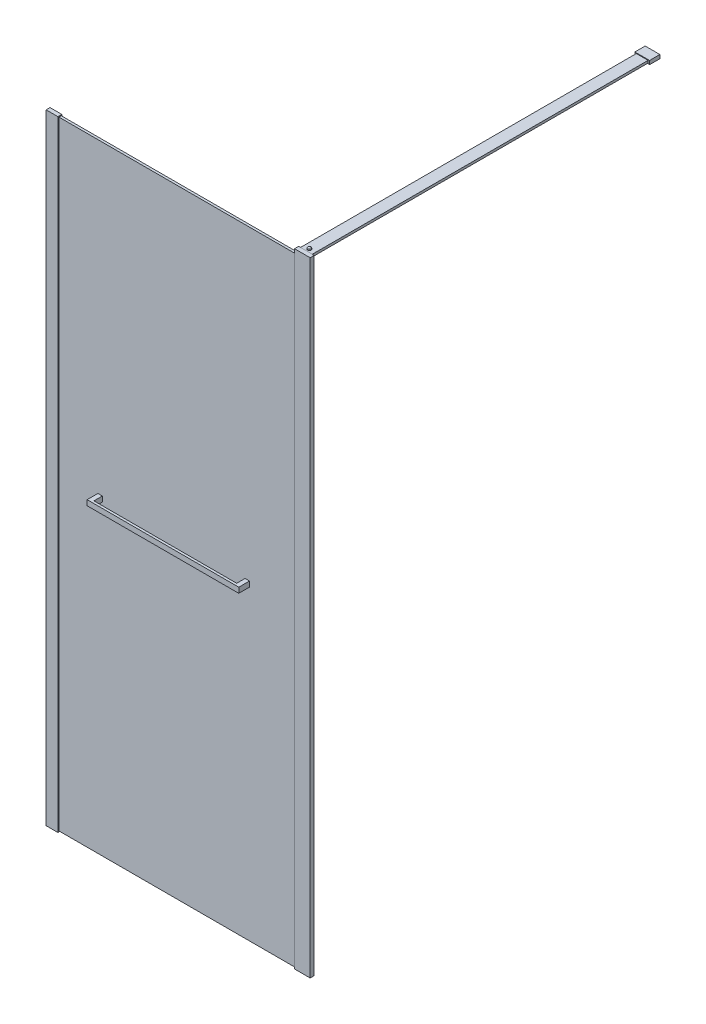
from build123d import *

# Parameters (mm, degrees)
DODANIE_WYCI_GNI_CIE1_START         = 3
DODANIE_WYCI_GNI_CIE1_DEPTH         = 2100
SZKIC2_W                            = 847
SZKIC2_H                            = 8
DODANIE_WYCI_GNI_CIE2_DEPTH         = 2100
DODANIE_WYCI_GNI_CIE3_DEPTH         = 2108
SZKIC4_W                            = 40
SZKIC4_H                            = 13.3
DODANIE_WYCI_GNI_CIE4_DEPTH         = 3
SZKIC5_W                            = 53
SZKIC5_H                            = 14
DODANIE_WYCI_GNI_CIE5_DEPTH         = 8
DODANIE_WYCI_GNI_CIE6_START         = -1.3
SZKIC6_W                            = 8.1
SZKIC6_H                            = 7.8
DODANIE_WYCI_GNI_CIE6_DEPTH         = 15
SZKIC7_W                            = 53
SZKIC7_H                            = 14
DODANIE_WYCI_GNI_CIE7_DEPTH         = 3
SZKIC8_W                            = 40
SZKIC8_H                            = 13.3
DODANIE_WYCI_GNI_CIE8_DEPTH         = 3
SZKIC9_W                            = 40
SZKIC9_H                            = 8
DODANIE_WYCI_GNI_CIE9_DEPTH         = 1170
DODANIE_WYCI_GNI_CIE10_START        = -29.4
SZKIC10_W                           = 50
SZKIC10_H                           = 12.5
DODANIE_WYCI_GNI_CIE10_DEPTH        = 35
DODANIE_WYCI_GNI_CIE11_DEPTH        = 36.5
DODANIE_WYCI_GNI_CIE11_DEPTH_BACK   = 18
SZKIC12_W                           = 15
SZKIC12_H                           = 18
DODANIE_WYCI_GNI_CIE11_2_DEPTH      = 36.5
DODANIE_WYCI_GNI_CIE11_2_DEPTH_BACK = 18
SZKIC13_W                           = 8
SZKIC13_H                           = 18
DODANIE_WYCI_GNI_CIE12_DEPTH        = 485


with BuildPart() as part:
    # Szkic1 → Dodanie-wyci_gni_cie1 (new body)
    with BuildSketch(Plane(origin=(0, 0, 0), x_dir=(1, 0, 0), z_dir=(0, 1, 0)).offset(DODANIE_WYCI_GNI_CIE1_START)):
        Polygon((0, 0), (0, 13.3), (40, 13.3), (40, 11.4), (6.5, 11.4), (6.5, 3.4), (40, 3.4), (40, 0), align=None)
    extrude(amount=DODANIE_WYCI_GNI_CIE1_DEPTH)

    # Szkic4 → Dodanie-wyci_gni_cie4 (add)
    with BuildSketch(Plane(origin=(0, 2103, 0), x_dir=(1, 0, 0), z_dir=(0, 1, 0))):
        with Locations((20, 6.65)):
            Rectangle(SZKIC4_W, SZKIC4_H)
    extrude(amount=DODANIE_WYCI_GNI_CIE4_DEPTH)

    # Szkic8 → Dodanie-wyci_gni_cie8 (add)
    with BuildSketch(Plane.XZ.offset(-3)):
        with Locations((20, -6.65)):
            Rectangle(SZKIC8_W, SZKIC8_H)
    extrude(amount=DODANIE_WYCI_GNI_CIE8_DEPTH)


with BuildPart() as body_2:
    # Szkic2 → Dodanie-wyci_gni_cie2 (new body)
    with BuildSketch(Plane.XZ.offset(-3)):
        with Locations((430, -7.4)):
            Rectangle(SZKIC2_W, SZKIC2_H)
    extrude(amount=-DODANIE_WYCI_GNI_CIE2_DEPTH)


with BuildPart() as body_3:
    # Szkic3 → Dodanie-wyci_gni_cie3 (new body)
    with BuildSketch(Plane.XZ.offset(-3)):
        Polygon((843.4, -3.4), (843.4, -0.4), (896.4, -0.4), (896.4, -14.4), (843.4, -14.4), (843.4, -11.4), (853.5, -11.4), (853.5, -3.4), align=None)
    extrude(amount=-DODANIE_WYCI_GNI_CIE3_DEPTH)

    # Szkic5 → Dodanie-wyci_gni_cie5 (add)
    with BuildSketch(Plane(origin=(0, 2111, 0), x_dir=(1, 0, 0), z_dir=(0, 1, 0))):
        with Locations((869.9, 7.4)):
            Rectangle(SZKIC5_W, SZKIC5_H)
    extrude(amount=DODANIE_WYCI_GNI_CIE5_DEPTH)

    # Szkic6 → Dodanie-wyci_gni_cie6 (add)
    with BuildSketch(Plane.ZY.offset(-843.4).offset(DODANIE_WYCI_GNI_CIE6_START)):
        with Locations((-7.4, 2107.1)):
            Rectangle(SZKIC6_W, SZKIC6_H)
    extrude(amount=-DODANIE_WYCI_GNI_CIE6_DEPTH)

    # Szkic7 → Dodanie-wyci_gni_cie7 (add)
    with BuildSketch(Plane.XZ.offset(-3)):
        with Locations((869.9, -7.4)):
            Rectangle(SZKIC7_W, SZKIC7_H)
    extrude(amount=DODANIE_WYCI_GNI_CIE7_DEPTH)


with BuildPart() as body_4:
    # Szkic9 → Dodanie-wyci_gni_cie9 (new body)
    with BuildSketch(Plane(origin=(0, 0, -14.4), x_dir=(-1, 0, 0), z_dir=(0, 0, -1))):
        with Locations((-869.9, 2115)):
            Rectangle(SZKIC9_W, SZKIC9_H)
    extrude(amount=DODANIE_WYCI_GNI_CIE9_DEPTH)

    # Szkic10 → Dodanie-wyci_gni_cie10 (add)
    with BuildSketch(Plane(origin=(0, 0, -1184.4), x_dir=(-1, 0, 0), z_dir=(0, 0, -1)).offset(DODANIE_WYCI_GNI_CIE10_START)):
        with Locations((-869.9, 2115)):
            Rectangle(SZKIC10_W, SZKIC10_H)
    extrude(amount=DODANIE_WYCI_GNI_CIE10_DEPTH)

    # Szkic11 → Obr_t1 (revolve)
    with BuildSketch(Plane(origin=(869.9, 0, 0), x_dir=(0, 0, -1), z_dir=(1, 0, 0))):
        with BuildLine():
            Line((30.3, 2119), (30.05, 2122.8))
            ThreePointArc((30.05, 2122.8), (27.38045718, 2124.212280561), (24.4, 2124.7))
            Line((24.4, 2124.7), (24.4, 2124.2))
            ThreePointArc((24.4, 2124.2), (27.113886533, 2123.773650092), (29.566308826, 2122.535676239))
            Line((29.566308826, 2122.535676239), (29.798919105, 2119))
            Line((29.798919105, 2119), (30.3, 2119))
        make_face()
    revolve(axis=Axis((869.9, 2119, -24.4), (0, 1, 0)))


with BuildPart() as body_5:
    # Szkic12 → Dodanie-wyci_gni_cie11 (new, two sides: drawn at the far end of the back side and taken through both)
    with BuildSketch(Plane.XY.offset(-3.4).offset(-DODANIE_WYCI_GNI_CIE11_DEPTH_BACK)):
        with Locations((180, 1053)):
            Rectangle(SZKIC12_W, SZKIC12_H)
    extrude(amount=DODANIE_WYCI_GNI_CIE11_DEPTH + DODANIE_WYCI_GNI_CIE11_DEPTH_BACK)



with BuildPart() as body_6:
    # Szkic12 → Dodanie-wyci_gni_cie11 2 (new, two sides: drawn at the far end of the back side and taken through both)
    with BuildSketch(Plane.XY.offset(-3.4).offset(-DODANIE_WYCI_GNI_CIE11_2_DEPTH_BACK)):
        with Locations((680, 1053)):
            Rectangle(SZKIC12_W, SZKIC12_H)
    extrude(amount=DODANIE_WYCI_GNI_CIE11_2_DEPTH + DODANIE_WYCI_GNI_CIE11_2_DEPTH_BACK)


with BuildPart() as body_5_1:
    add(body_5.part)

    add(body_6.part)  # Dodanie-wyci_gni_cie12 merges body 6
    # Szkic13 → Dodanie-wyci_gni_cie12 (add)
    with BuildSketch(Plane(origin=(187.5, 0, 0), x_dir=(0, 0, -1), z_dir=(1, 0, 0))):
        with Locations((-29.1, 1053)):
            Rectangle(SZKIC13_W, SZKIC13_H)
    extrude(amount=DODANIE_WYCI_GNI_CIE12_DEPTH)


solid = Compound([part.part, body_2.part, body_3.part, body_4.part, body_5_1.part])
